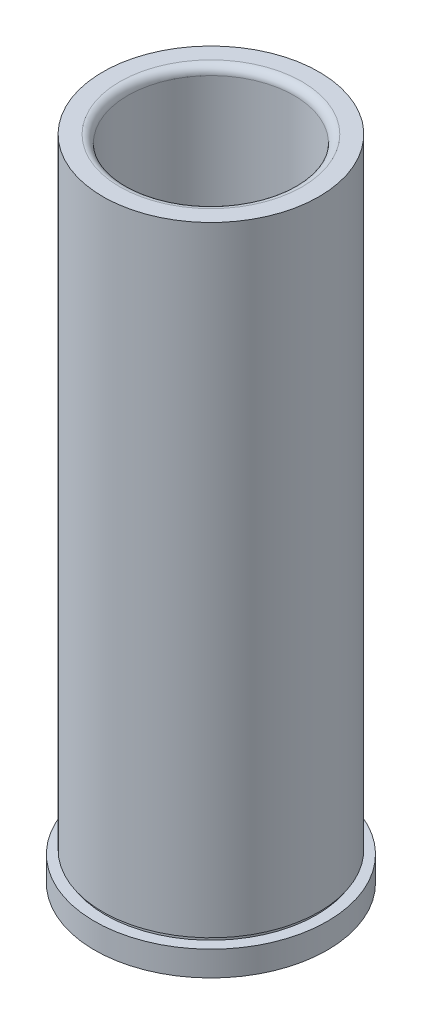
ISO-10303-21;
HEADER;
FILE_DESCRIPTION(('STEP AP214'),'2;1');
FILE_NAME('part.step','',(''),(''),'','','');
FILE_SCHEMA(('AUTOMOTIVE_DESIGN { 1 0 10303 214 1 1 1 1 }'));
ENDSEC;
DATA;
#1=APPLICATION_CONTEXT('core data for automotive mechanical design processes');
#2=APPLICATION_PROTOCOL_DEFINITION('international standard','automotive_design',2000,#1);
#3=PRODUCT_CONTEXT('',#1,'mechanical');
#4=PRODUCT('Part','Part','',(#3));
#5=PRODUCT_RELATED_PRODUCT_CATEGORY('part','',(#4));
#6=PRODUCT_DEFINITION_FORMATION('','',#4);
#7=PRODUCT_DEFINITION_CONTEXT('part definition',#1,'design');
#8=PRODUCT_DEFINITION('design','',#6,#7);
#9=PRODUCT_DEFINITION_SHAPE('','',#8);
#10=(LENGTH_UNIT() NAMED_UNIT(*) SI_UNIT(.MILLI.,.METRE.));
#11=(NAMED_UNIT(*) PLANE_ANGLE_UNIT() SI_UNIT($,.RADIAN.));
#12=(NAMED_UNIT(*) SI_UNIT($,.STERADIAN.) SOLID_ANGLE_UNIT());
#13=UNCERTAINTY_MEASURE_WITH_UNIT(LENGTH_MEASURE(1.E-05),#10,'distance_accuracy_value','');
#14=(GEOMETRIC_REPRESENTATION_CONTEXT(3) GLOBAL_UNCERTAINTY_ASSIGNED_CONTEXT((#13)) GLOBAL_UNIT_ASSIGNED_CONTEXT((#10,
#11,#12)) REPRESENTATION_CONTEXT('',''));
#15=CARTESIAN_POINT('',(0.,0.,0.));
#16=DIRECTION('',(0.,0.,1.));
#17=DIRECTION('',(1.,0.,0.));
#18=AXIS2_PLACEMENT_3D('',#15,#16,#17);
#19=CARTESIAN_POINT('',(-20.64385,123.825,0.));
#20=DIRECTION('',(0.,-1.,0.));
#21=DIRECTION('',(1.,0.,0.));
#22=AXIS2_PLACEMENT_3D('',#19,#20,#21);
#23=PLANE('',#22);
#24=CARTESIAN_POINT('',(-4.3233292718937E-13,123.825,0.));
#25=DIRECTION('',(0.,-1.,0.));
#26=DIRECTION('',(1.,0.,0.));
#27=AXIS2_PLACEMENT_3D('',#24,#25,#26);
#28=CIRCLE('',#27,17.4053499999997);
#29=CARTESIAN_POINT('',(17.4053499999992,123.825,0.));
#30=VERTEX_POINT('',#29);
#31=EDGE_CURVE('E36',#30,#30,#28,.T.);
#32=ORIENTED_EDGE('',*,*,#31,.T.);
#33=EDGE_LOOP('',(#32));
#34=FACE_BOUND('',#33,.T.);
#35=CARTESIAN_POINT('',(-4.3233292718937E-13,123.825,0.));
#36=DIRECTION('',(0.,-1.,0.));
#37=DIRECTION('',(1.,0.,0.));
#38=AXIS2_PLACEMENT_3D('',#35,#36,#37);
#39=CIRCLE('',#38,20.6438499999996);
#40=CARTESIAN_POINT('',(20.6438499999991,123.825,0.));
#41=VERTEX_POINT('',#40);
#42=EDGE_CURVE('E40',#41,#41,#39,.T.);
#43=ORIENTED_EDGE('',*,*,#42,.F.);
#44=EDGE_LOOP('',(#43));
#45=FACE_BOUND('',#44,.T.);
#46=ADVANCED_FACE('F29',(#34,#45),#23,.F.);
#47=CARTESIAN_POINT('',(3.49148336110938E-12,-1000.,0.));
#48=DIRECTION('',(0.,-1.,0.));
#49=DIRECTION('',(1.,0.,0.));
#50=AXIS2_PLACEMENT_3D('',#47,#48,#49);
#51=CYLINDRICAL_SURFACE('',#50,20.6438499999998);
#52=CARTESIAN_POINT('',(0.,5.52449999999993,0.));
#53=DIRECTION('',(0.,-1.,0.));
#54=DIRECTION('',(1.,0.,0.));
#55=AXIS2_PLACEMENT_3D('',#52,#53,#54);
#56=CIRCLE('',#55,20.64385);
#57=CARTESIAN_POINT('',(20.6438499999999,5.5245,0.));
#58=VERTEX_POINT('',#57);
#59=EDGE_CURVE('E44',#58,#58,#56,.T.);
#60=ORIENTED_EDGE('',*,*,#59,.F.);
#61=EDGE_LOOP('',(#60));
#62=FACE_BOUND('',#61,.T.);
#63=ORIENTED_EDGE('',*,*,#42,.T.);
#64=EDGE_LOOP('',(#63));
#65=FACE_BOUND('',#64,.T.);
#66=ADVANCED_FACE('F121',(#62,#65),#51,.T.);
#67=CARTESIAN_POINT('',(-20.64385,5.52450000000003,0.));
#68=DIRECTION('',(0.,1.,0.));
#69=DIRECTION('',(-1.,0.,0.));
#70=AXIS2_PLACEMENT_3D('',#67,#68,#69);
#71=PLANE('',#70);
#72=CARTESIAN_POINT('',(0.,5.52449999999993,0.));
#73=DIRECTION('',(0.,-1.,0.));
#74=DIRECTION('',(1.,0.,0.));
#75=AXIS2_PLACEMENT_3D('',#72,#73,#74);
#76=CIRCLE('',#75,20.13585);
#77=CARTESIAN_POINT('',(20.1358499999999,5.5245,0.));
#78=VERTEX_POINT('',#77);
#79=EDGE_CURVE('E49',#78,#78,#76,.T.);
#80=ORIENTED_EDGE('',*,*,#79,.F.);
#81=EDGE_LOOP('',(#80));
#82=FACE_BOUND('',#81,.T.);
#83=ORIENTED_EDGE('',*,*,#59,.T.);
#84=EDGE_LOOP('',(#83));
#85=FACE_BOUND('',#84,.T.);
#86=ADVANCED_FACE('F115',(#82,#85),#71,.F.);
#87=CARTESIAN_POINT('',(3.49148336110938E-12,-1000.,0.));
#88=DIRECTION('',(0.,-1.,0.));
#89=DIRECTION('',(1.,0.,0.));
#90=AXIS2_PLACEMENT_3D('',#87,#88,#89);
#91=CYLINDRICAL_SURFACE('',#90,20.13585);
#92=CARTESIAN_POINT('',(0.,4.7625,0.));
#93=DIRECTION('',(0.,-1.,0.));
#94=DIRECTION('',(1.,0.,0.));
#95=AXIS2_PLACEMENT_3D('',#92,#93,#94);
#96=CIRCLE('',#95,20.13585);
#97=CARTESIAN_POINT('',(20.1358499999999,4.76250000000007,0.));
#98=VERTEX_POINT('',#97);
#99=EDGE_CURVE('E52',#98,#98,#96,.T.);
#100=ORIENTED_EDGE('',*,*,#99,.F.);
#101=EDGE_LOOP('',(#100));
#102=FACE_BOUND('',#101,.T.);
#103=ORIENTED_EDGE('',*,*,#79,.T.);
#104=EDGE_LOOP('',(#103));
#105=FACE_BOUND('',#104,.T.);
#106=ADVANCED_FACE('F109',(#102,#105),#91,.T.);
#107=CARTESIAN_POINT('',(-22.225,4.76250000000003,0.));
#108=DIRECTION('',(0.,-1.,0.));
#109=DIRECTION('',(1.,0.,0.));
#110=AXIS2_PLACEMENT_3D('',#107,#108,#109);
#111=PLANE('',#110);
#112=CARTESIAN_POINT('',(0.,4.7625,0.));
#113=DIRECTION('',(0.,-1.,0.));
#114=DIRECTION('',(1.,0.,0.));
#115=AXIS2_PLACEMENT_3D('',#112,#113,#114);
#116=CIRCLE('',#115,22.225);
#117=CARTESIAN_POINT('',(22.225,4.76250000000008,0.));
#118=VERTEX_POINT('',#117);
#119=EDGE_CURVE('E55',#118,#118,#116,.T.);
#120=ORIENTED_EDGE('',*,*,#119,.F.);
#121=EDGE_LOOP('',(#120));
#122=FACE_BOUND('',#121,.T.);
#123=ORIENTED_EDGE('',*,*,#99,.T.);
#124=EDGE_LOOP('',(#123));
#125=FACE_BOUND('',#124,.T.);
#126=ADVANCED_FACE('F103',(#122,#125),#111,.F.);
#127=CARTESIAN_POINT('',(3.49148336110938E-12,-1000.,0.));
#128=DIRECTION('',(0.,-1.,0.));
#129=DIRECTION('',(1.,0.,0.));
#130=AXIS2_PLACEMENT_3D('',#127,#128,#129);
#131=CYLINDRICAL_SURFACE('',#130,22.225);
#132=CARTESIAN_POINT('',(0.,0.,0.));
#133=DIRECTION('',(0.,-1.,0.));
#134=DIRECTION('',(1.,0.,0.));
#135=AXIS2_PLACEMENT_3D('',#132,#133,#134);
#136=CIRCLE('',#135,22.225);
#137=CARTESIAN_POINT('',(22.225,0.,0.));
#138=VERTEX_POINT('',#137);
#139=EDGE_CURVE('E58',#138,#138,#136,.T.);
#140=ORIENTED_EDGE('',*,*,#139,.F.);
#141=EDGE_LOOP('',(#140));
#142=FACE_BOUND('',#141,.T.);
#143=ORIENTED_EDGE('',*,*,#119,.T.);
#144=EDGE_LOOP('',(#143));
#145=FACE_BOUND('',#144,.T.);
#146=ADVANCED_FACE('F97',(#142,#145),#131,.T.);
#147=CARTESIAN_POINT('',(-17.9451,0.,0.));
#148=DIRECTION('',(0.,1.,0.));
#149=DIRECTION('',(-1.,0.,0.));
#150=AXIS2_PLACEMENT_3D('',#147,#148,#149);
#151=PLANE('',#150);
#152=CARTESIAN_POINT('',(0.,0.,0.));
#153=DIRECTION('',(0.,-1.,0.));
#154=DIRECTION('',(1.,0.,0.));
#155=AXIS2_PLACEMENT_3D('',#152,#153,#154);
#156=CIRCLE('',#155,17.9451);
#157=CARTESIAN_POINT('',(17.9451,0.,0.));
#158=VERTEX_POINT('',#157);
#159=EDGE_CURVE('E61',#158,#158,#156,.T.);
#160=ORIENTED_EDGE('',*,*,#159,.F.);
#161=EDGE_LOOP('',(#160));
#162=FACE_BOUND('',#161,.T.);
#163=ORIENTED_EDGE('',*,*,#139,.T.);
#164=EDGE_LOOP('',(#163));
#165=FACE_BOUND('',#164,.T.);
#166=ADVANCED_FACE('F91',(#162,#165),#151,.F.);
#167=CARTESIAN_POINT('',(0.,0.,0.));
#168=DIRECTION('',(0.,-1.,0.));
#169=DIRECTION('',(1.,0.,0.));
#170=AXIS2_PLACEMENT_3D('',#167,#168,#169);
#171=CONICAL_SURFACE('',#170,17.9451,0.785398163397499);
#172=CARTESIAN_POINT('',(0.,0.793749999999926,0.));
#173=DIRECTION('',(0.,-1.,0.));
#174=DIRECTION('',(1.,0.,0.));
#175=AXIS2_PLACEMENT_3D('',#172,#173,#174);
#176=CIRCLE('',#175,17.15135);
#177=CARTESIAN_POINT('',(17.15135,0.793749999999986,0.));
#178=VERTEX_POINT('',#177);
#179=EDGE_CURVE('E64',#178,#178,#176,.T.);
#180=ORIENTED_EDGE('',*,*,#179,.F.);
#181=EDGE_LOOP('',(#180));
#182=FACE_BOUND('',#181,.T.);
#183=ORIENTED_EDGE('',*,*,#159,.T.);
#184=EDGE_LOOP('',(#183));
#185=FACE_BOUND('',#184,.T.);
#186=ADVANCED_FACE('F85',(#182,#185),#171,.F.);
#187=CARTESIAN_POINT('',(3.49148336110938E-12,-1000.,0.));
#188=DIRECTION('',(0.,-1.,0.));
#189=DIRECTION('',(1.,0.,0.));
#190=AXIS2_PLACEMENT_3D('',#187,#188,#189);
#191=CYLINDRICAL_SURFACE('',#190,17.1513499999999);
#192=CARTESIAN_POINT('',(-2.06189549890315E-13,59.0550000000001,0.));
#193=DIRECTION('',(0.,-1.,0.));
#194=DIRECTION('',(1.,0.,0.));
#195=AXIS2_PLACEMENT_3D('',#192,#193,#194);
#196=CIRCLE('',#195,17.1513499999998);
#197=CARTESIAN_POINT('',(17.1513499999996,59.0550000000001,0.));
#198=VERTEX_POINT('',#197);
#199=EDGE_CURVE('E67',#198,#198,#196,.T.);
#200=ORIENTED_EDGE('',*,*,#199,.F.);
#201=EDGE_LOOP('',(#200));
#202=FACE_BOUND('',#201,.T.);
#203=ORIENTED_EDGE('',*,*,#179,.T.);
#204=EDGE_LOOP('',(#203));
#205=FACE_BOUND('',#204,.T.);
#206=ADVANCED_FACE('F79',(#202,#205),#191,.F.);
#207=CARTESIAN_POINT('',(-2.08166817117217E-13,59.055,0.));
#208=DIRECTION('',(0.,-1.,0.));
#209=DIRECTION('',(1.,0.,0.));
#210=AXIS2_PLACEMENT_3D('',#207,#208,#209);
#211=TOROIDAL_SURFACE('',#210,15.8813499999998,1.27000000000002);
#212=CARTESIAN_POINT('',(-2.10623733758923E-13,60.325,0.));
#213=DIRECTION('',(0.,-1.,0.));
#214=DIRECTION('',(1.,0.,0.));
#215=AXIS2_PLACEMENT_3D('',#212,#213,#214);
#216=CIRCLE('',#215,15.8813499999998);
#217=CARTESIAN_POINT('',(15.8813499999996,60.325,0.));
#218=VERTEX_POINT('',#217);
#219=EDGE_CURVE('E70',#218,#218,#216,.T.);
#220=ORIENTED_EDGE('',*,*,#219,.F.);
#221=EDGE_LOOP('',(#220));
#222=FACE_BOUND('',#221,.T.);
#223=ORIENTED_EDGE('',*,*,#199,.T.);
#224=EDGE_LOOP('',(#223));
#225=FACE_BOUND('',#224,.T.);
#226=ADVANCED_FACE('F76',(#222,#225),#211,.F.);
#227=CARTESIAN_POINT('',(3.49148336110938E-12,-1000.,0.));
#228=DIRECTION('',(0.,-1.,0.));
#229=DIRECTION('',(1.,0.,0.));
#230=AXIS2_PLACEMENT_3D('',#227,#228,#229);
#231=CYLINDRICAL_SURFACE('',#230,15.8813499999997);
#232=CARTESIAN_POINT('',(-4.27011906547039E-13,122.301,0.));
#233=DIRECTION('',(0.,-1.,0.));
#234=DIRECTION('',(1.,0.,0.));
#235=AXIS2_PLACEMENT_3D('',#232,#233,#234);
#236=CIRCLE('',#235,15.8813499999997);
#237=CARTESIAN_POINT('',(15.8813499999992,122.301,0.));
#238=VERTEX_POINT('',#237);
#239=EDGE_CURVE('E10',#238,#238,#236,.F.);
#240=ORIENTED_EDGE('',*,*,#239,.T.);
#241=EDGE_LOOP('',(#240));
#242=FACE_BOUND('',#241,.T.);
#243=ORIENTED_EDGE('',*,*,#219,.T.);
#244=EDGE_LOOP('',(#243));
#245=FACE_BOUND('',#244,.T.);
#246=ADVANCED_FACE('F74',(#242,#245),#231,.F.);
#247=CARTESIAN_POINT('',(-4.27011906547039E-13,122.301,0.));
#248=DIRECTION('',(0.,-1.,0.));
#249=DIRECTION('',(1.,0.,0.));
#250=AXIS2_PLACEMENT_3D('',#247,#248,#249);
#251=TOROIDAL_SURFACE('',#250,17.4053499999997,1.524);
#252=ORIENTED_EDGE('',*,*,#239,.F.);
#253=EDGE_LOOP('',(#252));
#254=FACE_BOUND('',#253,.T.);
#255=ORIENTED_EDGE('',*,*,#31,.F.);
#256=EDGE_LOOP('',(#255));
#257=FACE_BOUND('',#256,.T.);
#258=ADVANCED_FACE('F31',(#254,#257),#251,.T.);
#259=CLOSED_SHELL('',(#46,#66,#86,#106,#126,#146,#166,#186,#206,#226,#246,#258));
#260=MANIFOLD_SOLID_BREP('B2',#259);
#261=ADVANCED_BREP_SHAPE_REPRESENTATION('',(#18,#260),#14);
#262=SHAPE_DEFINITION_REPRESENTATION(#9,#261);
ENDSEC;
END-ISO-10303-21;
